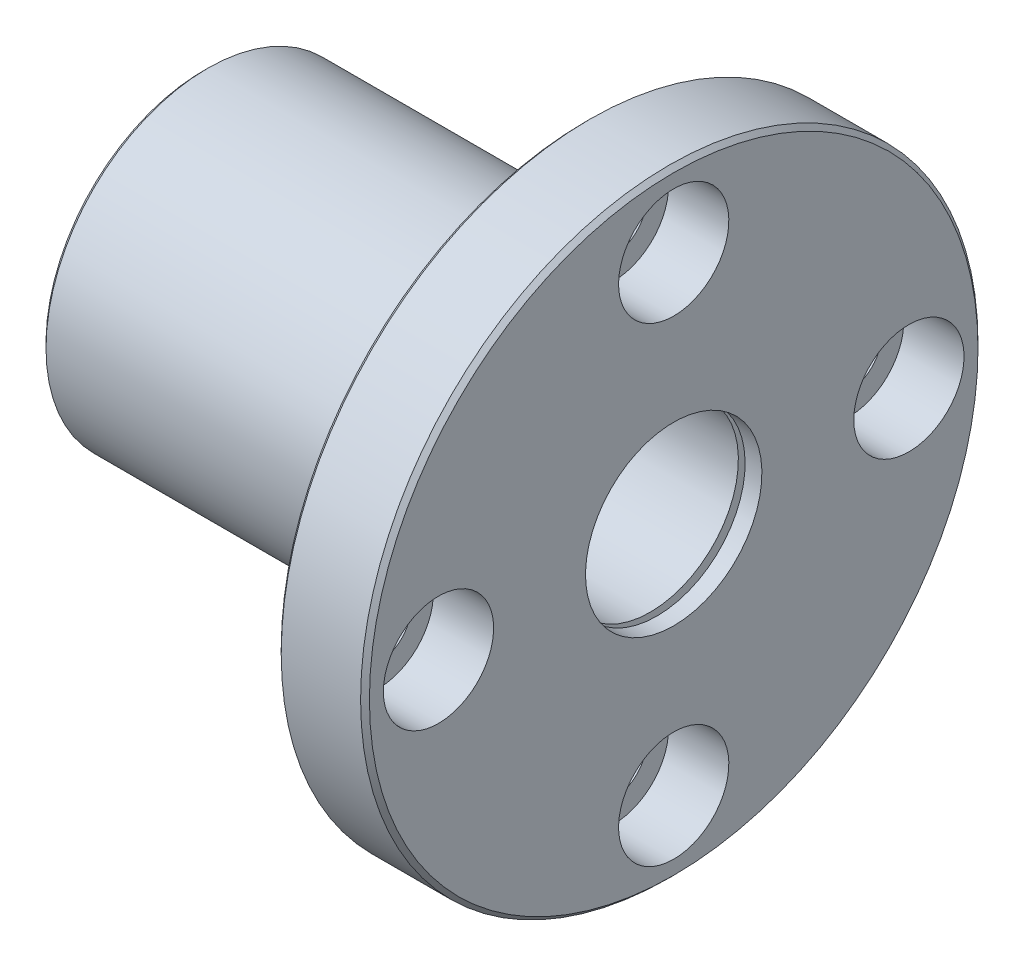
ISO-10303-21;
HEADER;
FILE_DESCRIPTION(('STEP AP214'),'2;1');
FILE_NAME('part.step','',(''),(''),'','','');
FILE_SCHEMA(('AUTOMOTIVE_DESIGN { 1 0 10303 214 1 1 1 1 }'));
ENDSEC;
DATA;
#1=APPLICATION_CONTEXT('core data for automotive mechanical design processes');
#2=APPLICATION_PROTOCOL_DEFINITION('international standard','automotive_design',2000,#1);
#3=PRODUCT_CONTEXT('',#1,'mechanical');
#4=PRODUCT('Part','Part','',(#3));
#5=PRODUCT_RELATED_PRODUCT_CATEGORY('part','',(#4));
#6=PRODUCT_DEFINITION_FORMATION('','',#4);
#7=PRODUCT_DEFINITION_CONTEXT('part definition',#1,'design');
#8=PRODUCT_DEFINITION('design','',#6,#7);
#9=PRODUCT_DEFINITION_SHAPE('','',#8);
#10=(LENGTH_UNIT() NAMED_UNIT(*) SI_UNIT(.MILLI.,.METRE.));
#11=(NAMED_UNIT(*) PLANE_ANGLE_UNIT() SI_UNIT($,.RADIAN.));
#12=(NAMED_UNIT(*) SI_UNIT($,.STERADIAN.) SOLID_ANGLE_UNIT());
#13=UNCERTAINTY_MEASURE_WITH_UNIT(LENGTH_MEASURE(1.E-05),#10,'distance_accuracy_value','');
#14=(GEOMETRIC_REPRESENTATION_CONTEXT(3) GLOBAL_UNCERTAINTY_ASSIGNED_CONTEXT((#13)) GLOBAL_UNIT_ASSIGNED_CONTEXT((#10,
#11,#12)) REPRESENTATION_CONTEXT('',''));
#15=CARTESIAN_POINT('',(0.,0.,0.));
#16=DIRECTION('',(0.,0.,1.));
#17=DIRECTION('',(1.,0.,0.));
#18=AXIS2_PLACEMENT_3D('',#15,#16,#17);
#19=CARTESIAN_POINT('',(0.,8.6,0.));
#20=DIRECTION('',(-1.,0.,0.));
#21=DIRECTION('',(0.,0.,1.));
#22=AXIS2_PLACEMENT_3D('',#19,#20,#21);
#23=PLANE('',#22);
#24=CARTESIAN_POINT('',(0.,0.,0.));
#25=DIRECTION('',(-1.,0.,0.));
#26=DIRECTION('',(0.,1.,0.));
#27=AXIS2_PLACEMENT_3D('',#24,#25,#26);
#28=CIRCLE('',#27,6.5);
#29=CARTESIAN_POINT('',(0.,-6.5,0.));
#30=VERTEX_POINT('',#29);
#31=EDGE_CURVE('E229',#30,#30,#28,.T.);
#32=ORIENTED_EDGE('',*,*,#31,.F.);
#33=EDGE_LOOP('',(#32));
#34=FACE_BOUND('',#33,.T.);
#35=CARTESIAN_POINT('',(0.,0.,0.));
#36=DIRECTION('',(-1.,0.,0.));
#37=DIRECTION('',(0.,1.,0.));
#38=AXIS2_PLACEMENT_3D('',#35,#36,#37);
#39=CIRCLE('',#38,10.7);
#40=CARTESIAN_POINT('',(0.,-10.7,0.));
#41=VERTEX_POINT('',#40);
#42=EDGE_CURVE('E238',#41,#41,#39,.T.);
#43=ORIENTED_EDGE('',*,*,#42,.T.);
#44=EDGE_LOOP('',(#43));
#45=FACE_BOUND('',#44,.T.);
#46=ADVANCED_FACE('F16',(#34,#45),#23,.T.);
#47=CARTESIAN_POINT('',(26.,16.0190437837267,0.));
#48=DIRECTION('',(-1.,0.,0.));
#49=DIRECTION('',(0.,0.,1.));
#50=AXIS2_PLACEMENT_3D('',#47,#48,#49);
#51=PLANE('',#50);
#52=CARTESIAN_POINT('',(26.,0.,0.));
#53=DIRECTION('',(-1.,0.,0.));
#54=DIRECTION('',(0.,1.,0.));
#55=AXIS2_PLACEMENT_3D('',#52,#53,#54);
#56=CIRCLE('',#55,11.3380875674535);
#57=CARTESIAN_POINT('',(26.,11.3380875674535,0.));
#58=VERTEX_POINT('',#57);
#59=CARTESIAN_POINT('',(26.,0.,-11.3380875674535));
#60=VERTEX_POINT('',#59);
#61=EDGE_CURVE('E216',#58,#60,#56,.T.);
#62=ORIENTED_EDGE('',*,*,#61,.F.);
#63=CARTESIAN_POINT('',(26.,0.,0.));
#64=DIRECTION('',(-1.,0.,0.));
#65=DIRECTION('',(0.,1.,0.));
#66=AXIS2_PLACEMENT_3D('',#63,#64,#65);
#67=CIRCLE('',#66,11.3380875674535);
#68=EDGE_CURVE('E214',#60,#58,#67,.T.);
#69=ORIENTED_EDGE('',*,*,#68,.F.);
#70=EDGE_LOOP('',(#62,#69));
#71=FACE_BOUND('',#70,.T.);
#72=CARTESIAN_POINT('',(26.,16.,0.));
#73=DIRECTION('',(1.,0.,0.));
#74=DIRECTION('',(0.,1.,0.));
#75=AXIS2_PLACEMENT_3D('',#72,#73,#74);
#76=CIRCLE('',#75,2.25);
#77=CARTESIAN_POINT('',(26.,13.75,0.));
#78=VERTEX_POINT('',#77);
#79=EDGE_CURVE('E328',#78,#78,#76,.T.);
#80=ORIENTED_EDGE('',*,*,#79,.T.);
#81=EDGE_LOOP('',(#80));
#82=FACE_BOUND('',#81,.T.);
#83=CARTESIAN_POINT('',(26.,-16.,0.));
#84=DIRECTION('',(1.,0.,0.));
#85=DIRECTION('',(0.,1.,0.));
#86=AXIS2_PLACEMENT_3D('',#83,#84,#85);
#87=CIRCLE('',#86,2.25);
#88=CARTESIAN_POINT('',(26.,-18.25,0.));
#89=VERTEX_POINT('',#88);
#90=EDGE_CURVE('E350',#89,#89,#87,.T.);
#91=ORIENTED_EDGE('',*,*,#90,.T.);
#92=EDGE_LOOP('',(#91));
#93=FACE_BOUND('',#92,.T.);
#94=CARTESIAN_POINT('',(26.,0.,16.));
#95=DIRECTION('',(1.,0.,0.));
#96=DIRECTION('',(0.,0.,-1.));
#97=AXIS2_PLACEMENT_3D('',#94,#95,#96);
#98=CIRCLE('',#97,2.25);
#99=CARTESIAN_POINT('',(26.,0.,18.25));
#100=VERTEX_POINT('',#99);
#101=EDGE_CURVE('E299',#100,#100,#98,.T.);
#102=ORIENTED_EDGE('',*,*,#101,.T.);
#103=EDGE_LOOP('',(#102));
#104=FACE_BOUND('',#103,.T.);
#105=CARTESIAN_POINT('',(26.,0.,-16.));
#106=DIRECTION('',(1.,0.,0.));
#107=DIRECTION('',(0.,0.,-1.));
#108=AXIS2_PLACEMENT_3D('',#105,#106,#107);
#109=CIRCLE('',#108,2.25);
#110=CARTESIAN_POINT('',(26.,0.,-13.75));
#111=VERTEX_POINT('',#110);
#112=EDGE_CURVE('E315',#111,#111,#109,.T.);
#113=ORIENTED_EDGE('',*,*,#112,.T.);
#114=EDGE_LOOP('',(#113));
#115=FACE_BOUND('',#114,.T.);
#116=CARTESIAN_POINT('',(26.,0.,0.));
#117=DIRECTION('',(-1.,0.,0.));
#118=DIRECTION('',(0.,1.,0.));
#119=AXIS2_PLACEMENT_3D('',#116,#117,#118);
#120=CIRCLE('',#119,20.7);
#121=CARTESIAN_POINT('',(26.,-20.7,0.));
#122=VERTEX_POINT('',#121);
#123=EDGE_CURVE('E243',#122,#122,#120,.T.);
#124=ORIENTED_EDGE('',*,*,#123,.T.);
#125=EDGE_LOOP('',(#124));
#126=FACE_BOUND('',#125,.T.);
#127=ADVANCED_FACE('F18',(#71,#82,#93,#104,#115,#126),#51,.T.);
#128=CARTESIAN_POINT('',(32.,13.35,0.));
#129=DIRECTION('',(1.,0.,0.));
#130=DIRECTION('',(0.,1.,0.));
#131=AXIS2_PLACEMENT_3D('',#128,#129,#130);
#132=PLANE('',#131);
#133=CARTESIAN_POINT('',(32.,16.,0.));
#134=DIRECTION('',(-1.,0.,0.));
#135=DIRECTION('',(0.,1.,0.));
#136=AXIS2_PLACEMENT_3D('',#133,#134,#135);
#137=CIRCLE('',#136,3.75);
#138=CARTESIAN_POINT('',(32.,12.25,0.));
#139=VERTEX_POINT('',#138);
#140=EDGE_CURVE('E347',#139,#139,#137,.T.);
#141=ORIENTED_EDGE('',*,*,#140,.T.);
#142=EDGE_LOOP('',(#141));
#143=FACE_BOUND('',#142,.T.);
#144=CARTESIAN_POINT('',(32.,-16.,0.));
#145=DIRECTION('',(-1.,0.,0.));
#146=DIRECTION('',(0.,1.,0.));
#147=AXIS2_PLACEMENT_3D('',#144,#145,#146);
#148=CIRCLE('',#147,3.75);
#149=CARTESIAN_POINT('',(32.,-19.75,0.));
#150=VERTEX_POINT('',#149);
#151=EDGE_CURVE('E304',#150,#150,#148,.T.);
#152=ORIENTED_EDGE('',*,*,#151,.T.);
#153=EDGE_LOOP('',(#152));
#154=FACE_BOUND('',#153,.T.);
#155=CARTESIAN_POINT('',(32.,0.,16.));
#156=DIRECTION('',(-1.,0.,0.));
#157=DIRECTION('',(0.,0.,-1.));
#158=AXIS2_PLACEMENT_3D('',#155,#156,#157);
#159=CIRCLE('',#158,3.75);
#160=CARTESIAN_POINT('',(32.,0.,19.75));
#161=VERTEX_POINT('',#160);
#162=EDGE_CURVE('E312',#161,#161,#159,.T.);
#163=ORIENTED_EDGE('',*,*,#162,.T.);
#164=EDGE_LOOP('',(#163));
#165=FACE_BOUND('',#164,.T.);
#166=CARTESIAN_POINT('',(32.,0.,-16.));
#167=DIRECTION('',(-1.,0.,0.));
#168=DIRECTION('',(0.,0.,-1.));
#169=AXIS2_PLACEMENT_3D('',#166,#167,#168);
#170=CIRCLE('',#169,3.75);
#171=CARTESIAN_POINT('',(32.,0.,-12.25));
#172=VERTEX_POINT('',#171);
#173=EDGE_CURVE('E10',#172,#172,#170,.T.);
#174=ORIENTED_EDGE('',*,*,#173,.T.);
#175=EDGE_LOOP('',(#174));
#176=FACE_BOUND('',#175,.T.);
#177=CARTESIAN_POINT('',(32.,0.,0.));
#178=DIRECTION('',(-1.,0.,0.));
#179=DIRECTION('',(0.,1.,0.));
#180=AXIS2_PLACEMENT_3D('',#177,#178,#179);
#181=CIRCLE('',#180,6.);
#182=CARTESIAN_POINT('',(32.,-6.,0.));
#183=VERTEX_POINT('',#182);
#184=EDGE_CURVE('E276',#183,#183,#181,.T.);
#185=ORIENTED_EDGE('',*,*,#184,.T.);
#186=EDGE_LOOP('',(#185));
#187=FACE_BOUND('',#186,.T.);
#188=CARTESIAN_POINT('',(32.,0.,0.));
#189=DIRECTION('',(-1.,0.,0.));
#190=DIRECTION('',(0.,1.,0.));
#191=AXIS2_PLACEMENT_3D('',#188,#189,#190);
#192=CIRCLE('',#191,20.7);
#193=CARTESIAN_POINT('',(32.,-20.7,0.));
#194=VERTEX_POINT('',#193);
#195=EDGE_CURVE('E260',#194,#194,#192,.T.);
#196=ORIENTED_EDGE('',*,*,#195,.F.);
#197=EDGE_LOOP('',(#196));
#198=FACE_BOUND('',#197,.T.);
#199=ADVANCED_FACE('F418',(#143,#154,#165,#176,#187,#198),#132,.T.);
#200=CARTESIAN_POINT('',(30.8571428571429,6.55,0.));
#201=DIRECTION('',(-1.,0.,0.));
#202=DIRECTION('',(0.,0.,1.));
#203=AXIS2_PLACEMENT_3D('',#200,#201,#202);
#204=PLANE('',#203);
#205=CARTESIAN_POINT('',(30.8571428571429,0.,0.));
#206=DIRECTION('',(-1.,0.,0.));
#207=DIRECTION('',(0.,1.,0.));
#208=AXIS2_PLACEMENT_3D('',#205,#206,#207);
#209=CIRCLE('',#208,6.);
#210=CARTESIAN_POINT('',(30.8571428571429,-6.,0.));
#211=VERTEX_POINT('',#210);
#212=EDGE_CURVE('E268',#211,#211,#209,.T.);
#213=ORIENTED_EDGE('',*,*,#212,.F.);
#214=EDGE_LOOP('',(#213));
#215=FACE_BOUND('',#214,.T.);
#216=CARTESIAN_POINT('',(30.8571428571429,0.,0.));
#217=DIRECTION('',(-1.,0.,0.));
#218=DIRECTION('',(0.,1.,0.));
#219=AXIS2_PLACEMENT_3D('',#216,#217,#218);
#220=CIRCLE('',#219,7.1);
#221=CARTESIAN_POINT('',(30.8571428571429,-7.1,0.));
#222=VERTEX_POINT('',#221);
#223=EDGE_CURVE('E287',#222,#222,#220,.T.);
#224=ORIENTED_EDGE('',*,*,#223,.T.);
#225=EDGE_LOOP('',(#224));
#226=FACE_BOUND('',#225,.T.);
#227=ADVANCED_FACE('F494',(#215,#226),#204,.T.);
#228=CARTESIAN_POINT('',(30.4,6.55,0.));
#229=DIRECTION('',(1.,0.,0.));
#230=DIRECTION('',(0.,-1.,0.));
#231=AXIS2_PLACEMENT_3D('',#228,#229,#230);
#232=PLANE('',#231);
#233=CARTESIAN_POINT('',(30.4,0.,0.));
#234=DIRECTION('',(-1.,0.,0.));
#235=DIRECTION('',(0.,1.,0.));
#236=AXIS2_PLACEMENT_3D('',#233,#234,#235);
#237=CIRCLE('',#236,6.);
#238=CARTESIAN_POINT('',(30.4,-6.,0.));
#239=VERTEX_POINT('',#238);
#240=EDGE_CURVE('E298',#239,#239,#237,.T.);
#241=ORIENTED_EDGE('',*,*,#240,.T.);
#242=EDGE_LOOP('',(#241));
#243=FACE_BOUND('',#242,.T.);
#244=CARTESIAN_POINT('',(30.4,0.,0.));
#245=DIRECTION('',(-1.,0.,0.));
#246=DIRECTION('',(0.,1.,0.));
#247=AXIS2_PLACEMENT_3D('',#244,#245,#246);
#248=CIRCLE('',#247,7.1);
#249=CARTESIAN_POINT('',(30.4,-7.1,0.));
#250=VERTEX_POINT('',#249);
#251=EDGE_CURVE('E279',#250,#250,#248,.T.);
#252=ORIENTED_EDGE('',*,*,#251,.F.);
#253=EDGE_LOOP('',(#252));
#254=FACE_BOUND('',#253,.T.);
#255=ADVANCED_FACE('F490',(#243,#254),#232,.T.);
#256=CARTESIAN_POINT('',(1.6,6.55,0.));
#257=DIRECTION('',(-1.,0.,0.));
#258=DIRECTION('',(0.,0.,1.));
#259=AXIS2_PLACEMENT_3D('',#256,#257,#258);
#260=PLANE('',#259);
#261=CARTESIAN_POINT('',(1.6,0.,0.));
#262=DIRECTION('',(-1.,0.,0.));
#263=DIRECTION('',(0.,1.,0.));
#264=AXIS2_PLACEMENT_3D('',#261,#262,#263);
#265=CIRCLE('',#264,6.);
#266=CARTESIAN_POINT('',(1.6,-6.,0.));
#267=VERTEX_POINT('',#266);
#268=EDGE_CURVE('E288',#267,#267,#265,.T.);
#269=ORIENTED_EDGE('',*,*,#268,.F.);
#270=EDGE_LOOP('',(#269));
#271=FACE_BOUND('',#270,.T.);
#272=CARTESIAN_POINT('',(1.6,0.,0.));
#273=DIRECTION('',(-1.,0.,0.));
#274=DIRECTION('',(0.,1.,0.));
#275=AXIS2_PLACEMENT_3D('',#272,#273,#274);
#276=CIRCLE('',#275,7.1);
#277=CARTESIAN_POINT('',(1.6,-7.1,0.));
#278=VERTEX_POINT('',#277);
#279=EDGE_CURVE('E234',#278,#278,#276,.T.);
#280=ORIENTED_EDGE('',*,*,#279,.T.);
#281=EDGE_LOOP('',(#280));
#282=FACE_BOUND('',#281,.T.);
#283=ADVANCED_FACE('F487',(#271,#282),#260,.T.);
#284=CARTESIAN_POINT('',(1.14285714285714,6.8,0.));
#285=DIRECTION('',(1.,0.,0.));
#286=DIRECTION('',(0.,1.,0.));
#287=AXIS2_PLACEMENT_3D('',#284,#285,#286);
#288=PLANE('',#287);
#289=CARTESIAN_POINT('',(1.14285714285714,0.,0.));
#290=DIRECTION('',(-1.,0.,0.));
#291=DIRECTION('',(0.,1.,0.));
#292=AXIS2_PLACEMENT_3D('',#289,#290,#291);
#293=CIRCLE('',#292,6.5);
#294=CARTESIAN_POINT('',(1.14285714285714,-6.5,0.));
#295=VERTEX_POINT('',#294);
#296=EDGE_CURVE('E325',#295,#295,#293,.T.);
#297=ORIENTED_EDGE('',*,*,#296,.T.);
#298=EDGE_LOOP('',(#297));
#299=FACE_BOUND('',#298,.T.);
#300=CARTESIAN_POINT('',(1.14285714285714,0.,0.));
#301=DIRECTION('',(-1.,0.,0.));
#302=DIRECTION('',(0.,1.,0.));
#303=AXIS2_PLACEMENT_3D('',#300,#301,#302);
#304=CIRCLE('',#303,7.1);
#305=CARTESIAN_POINT('',(1.14285714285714,-7.1,0.));
#306=VERTEX_POINT('',#305);
#307=EDGE_CURVE('E307',#306,#306,#304,.T.);
#308=ORIENTED_EDGE('',*,*,#307,.F.);
#309=EDGE_LOOP('',(#308));
#310=FACE_BOUND('',#309,.T.);
#311=ADVANCED_FACE('F469',(#299,#310),#288,.T.);
#312=CARTESIAN_POINT('',(27.9,19.,0.));
#313=DIRECTION('',(-1.,0.,0.));
#314=DIRECTION('',(0.,0.,1.));
#315=AXIS2_PLACEMENT_3D('',#312,#313,#314);
#316=PLANE('',#315);
#317=CARTESIAN_POINT('',(27.9,16.,0.));
#318=DIRECTION('',(-1.,0.,0.));
#319=DIRECTION('',(0.,1.,0.));
#320=AXIS2_PLACEMENT_3D('',#317,#318,#319);
#321=CIRCLE('',#320,2.25);
#322=CARTESIAN_POINT('',(27.9,13.75,0.));
#323=VERTEX_POINT('',#322);
#324=EDGE_CURVE('E336',#323,#323,#321,.T.);
#325=ORIENTED_EDGE('',*,*,#324,.T.);
#326=EDGE_LOOP('',(#325));
#327=FACE_BOUND('',#326,.T.);
#328=CARTESIAN_POINT('',(27.9,16.,0.));
#329=DIRECTION('',(-1.,0.,0.));
#330=DIRECTION('',(0.,1.,0.));
#331=AXIS2_PLACEMENT_3D('',#328,#329,#330);
#332=CIRCLE('',#331,3.75);
#333=CARTESIAN_POINT('',(27.9,12.25,0.));
#334=VERTEX_POINT('',#333);
#335=EDGE_CURVE('E339',#334,#334,#332,.T.);
#336=ORIENTED_EDGE('',*,*,#335,.F.);
#337=EDGE_LOOP('',(#336));
#338=FACE_BOUND('',#337,.T.);
#339=ADVANCED_FACE('F465',(#327,#338),#316,.F.);
#340=CARTESIAN_POINT('',(27.9,-13.,0.));
#341=DIRECTION('',(-1.,0.,0.));
#342=DIRECTION('',(0.,0.,1.));
#343=AXIS2_PLACEMENT_3D('',#340,#341,#342);
#344=PLANE('',#343);
#345=CARTESIAN_POINT('',(27.9,-16.,0.));
#346=DIRECTION('',(-1.,0.,0.));
#347=DIRECTION('',(0.,1.,0.));
#348=AXIS2_PLACEMENT_3D('',#345,#346,#347);
#349=CIRCLE('',#348,2.25);
#350=CARTESIAN_POINT('',(27.9,-18.25,0.));
#351=VERTEX_POINT('',#350);
#352=EDGE_CURVE('E358',#351,#351,#349,.T.);
#353=ORIENTED_EDGE('',*,*,#352,.T.);
#354=EDGE_LOOP('',(#353));
#355=FACE_BOUND('',#354,.T.);
#356=CARTESIAN_POINT('',(27.9,-16.,0.));
#357=DIRECTION('',(-1.,0.,0.));
#358=DIRECTION('',(0.,1.,0.));
#359=AXIS2_PLACEMENT_3D('',#356,#357,#358);
#360=CIRCLE('',#359,3.75);
#361=CARTESIAN_POINT('',(27.9,-19.75,0.));
#362=VERTEX_POINT('',#361);
#363=EDGE_CURVE('E361',#362,#362,#360,.T.);
#364=ORIENTED_EDGE('',*,*,#363,.F.);
#365=EDGE_LOOP('',(#364));
#366=FACE_BOUND('',#365,.T.);
#367=ADVANCED_FACE('F468',(#355,#366),#344,.F.);
#368=CARTESIAN_POINT('',(27.9,0.,13.));
#369=DIRECTION('',(-1.,0.,0.));
#370=DIRECTION('',(0.,0.,1.));
#371=AXIS2_PLACEMENT_3D('',#368,#369,#370);
#372=PLANE('',#371);
#373=CARTESIAN_POINT('',(27.9,0.,16.));
#374=DIRECTION('',(-1.,0.,0.));
#375=DIRECTION('',(0.,0.,-1.));
#376=AXIS2_PLACEMENT_3D('',#373,#374,#375);
#377=CIRCLE('',#376,2.25);
#378=CARTESIAN_POINT('',(27.9,0.,18.25));
#379=VERTEX_POINT('',#378);
#380=EDGE_CURVE('E377',#379,#379,#377,.T.);
#381=ORIENTED_EDGE('',*,*,#380,.T.);
#382=EDGE_LOOP('',(#381));
#383=FACE_BOUND('',#382,.T.);
#384=CARTESIAN_POINT('',(27.9,0.,16.));
#385=DIRECTION('',(-1.,0.,0.));
#386=DIRECTION('',(0.,0.,-1.));
#387=AXIS2_PLACEMENT_3D('',#384,#385,#386);
#388=CIRCLE('',#387,3.75);
#389=CARTESIAN_POINT('',(27.9,0.,19.75));
#390=VERTEX_POINT('',#389);
#391=EDGE_CURVE('E380',#390,#390,#388,.T.);
#392=ORIENTED_EDGE('',*,*,#391,.F.);
#393=EDGE_LOOP('',(#392));
#394=FACE_BOUND('',#393,.T.);
#395=ADVANCED_FACE('F409',(#383,#394),#372,.F.);
#396=CARTESIAN_POINT('',(27.9,0.,-19.));
#397=DIRECTION('',(-1.,0.,0.));
#398=DIRECTION('',(0.,0.,1.));
#399=AXIS2_PLACEMENT_3D('',#396,#397,#398);
#400=PLANE('',#399);
#401=CARTESIAN_POINT('',(27.9,0.,-16.));
#402=DIRECTION('',(-1.,0.,0.));
#403=DIRECTION('',(0.,0.,-1.));
#404=AXIS2_PLACEMENT_3D('',#401,#402,#403);
#405=CIRCLE('',#404,2.25);
#406=CARTESIAN_POINT('',(27.9,0.,-13.75));
#407=VERTEX_POINT('',#406);
#408=EDGE_CURVE('E261',#407,#407,#405,.T.);
#409=ORIENTED_EDGE('',*,*,#408,.T.);
#410=EDGE_LOOP('',(#409));
#411=FACE_BOUND('',#410,.T.);
#412=CARTESIAN_POINT('',(27.9,0.,-16.));
#413=DIRECTION('',(-1.,0.,0.));
#414=DIRECTION('',(0.,0.,-1.));
#415=AXIS2_PLACEMENT_3D('',#412,#413,#414);
#416=CIRCLE('',#415,3.75);
#417=CARTESIAN_POINT('',(27.9,0.,-12.25));
#418=VERTEX_POINT('',#417);
#419=EDGE_CURVE('E264',#418,#418,#416,.T.);
#420=ORIENTED_EDGE('',*,*,#419,.F.);
#421=EDGE_LOOP('',(#420));
#422=FACE_BOUND('',#421,.T.);
#423=ADVANCED_FACE('F399',(#411,#422),#400,.F.);
#424=CARTESIAN_POINT('',(29.95,0.,-16.));
#425=DIRECTION('',(1.,0.,0.));
#426=DIRECTION('',(0.,0.,-1.));
#427=AXIS2_PLACEMENT_3D('',#424,#425,#426);
#428=CYLINDRICAL_SURFACE('',#427,3.75);
#429=ORIENTED_EDGE('',*,*,#419,.T.);
#430=DIRECTION('',(1.,0.,0.));
#431=VECTOR('',#430,1.);
#432=CARTESIAN_POINT('',(29.95,0.,-12.25));
#433=LINE('',#432,#431);
#434=EDGE_CURVE('E20',#418,#172,#433,.T.);
#435=ORIENTED_EDGE('',*,*,#434,.T.);
#436=ORIENTED_EDGE('',*,*,#173,.F.);
#437=ORIENTED_EDGE('',*,*,#434,.F.);
#438=EDGE_LOOP('',(#429,#435,#436,#437));
#439=FACE_BOUND('',#438,.T.);
#440=ADVANCED_FACE('F396',(#439),#428,.F.);
#441=CARTESIAN_POINT('',(26.95,0.,-16.));
#442=DIRECTION('',(1.,0.,0.));
#443=DIRECTION('',(0.,0.,-1.));
#444=AXIS2_PLACEMENT_3D('',#441,#442,#443);
#445=CYLINDRICAL_SURFACE('',#444,2.25);
#446=ORIENTED_EDGE('',*,*,#112,.F.);
#447=DIRECTION('',(1.,0.,0.));
#448=VECTOR('',#447,1.);
#449=CARTESIAN_POINT('',(26.95,0.,-13.75));
#450=LINE('',#449,#448);
#451=EDGE_CURVE('E265',#111,#407,#450,.T.);
#452=ORIENTED_EDGE('',*,*,#451,.T.);
#453=ORIENTED_EDGE('',*,*,#408,.F.);
#454=ORIENTED_EDGE('',*,*,#451,.F.);
#455=EDGE_LOOP('',(#446,#452,#453,#454));
#456=FACE_BOUND('',#455,.T.);
#457=ADVANCED_FACE('F398',(#456),#445,.F.);
#458=CARTESIAN_POINT('',(29.95,0.,16.));
#459=DIRECTION('',(1.,0.,0.));
#460=DIRECTION('',(0.,0.,-1.));
#461=AXIS2_PLACEMENT_3D('',#458,#459,#460);
#462=CYLINDRICAL_SURFACE('',#461,3.75);
#463=ORIENTED_EDGE('',*,*,#391,.T.);
#464=DIRECTION('',(1.,0.,0.));
#465=VECTOR('',#464,1.);
#466=CARTESIAN_POINT('',(29.95,0.,19.75));
#467=LINE('',#466,#465);
#468=EDGE_CURVE('E316',#390,#161,#467,.T.);
#469=ORIENTED_EDGE('',*,*,#468,.T.);
#470=ORIENTED_EDGE('',*,*,#162,.F.);
#471=ORIENTED_EDGE('',*,*,#468,.F.);
#472=EDGE_LOOP('',(#463,#469,#470,#471));
#473=FACE_BOUND('',#472,.T.);
#474=ADVANCED_FACE('F406',(#473),#462,.F.);
#475=CARTESIAN_POINT('',(26.95,0.,16.));
#476=DIRECTION('',(1.,0.,0.));
#477=DIRECTION('',(0.,0.,-1.));
#478=AXIS2_PLACEMENT_3D('',#475,#476,#477);
#479=CYLINDRICAL_SURFACE('',#478,2.25);
#480=ORIENTED_EDGE('',*,*,#101,.F.);
#481=DIRECTION('',(1.,0.,0.));
#482=VECTOR('',#481,1.);
#483=CARTESIAN_POINT('',(26.95,0.,18.25));
#484=LINE('',#483,#482);
#485=EDGE_CURVE('E303',#100,#379,#484,.T.);
#486=ORIENTED_EDGE('',*,*,#485,.T.);
#487=ORIENTED_EDGE('',*,*,#380,.F.);
#488=ORIENTED_EDGE('',*,*,#485,.F.);
#489=EDGE_LOOP('',(#480,#486,#487,#488));
#490=FACE_BOUND('',#489,.T.);
#491=ADVANCED_FACE('F461',(#490),#479,.F.);
#492=CARTESIAN_POINT('',(29.95,-16.,0.));
#493=DIRECTION('',(1.,0.,0.));
#494=DIRECTION('',(0.,1.,0.));
#495=AXIS2_PLACEMENT_3D('',#492,#493,#494);
#496=CYLINDRICAL_SURFACE('',#495,3.75);
#497=ORIENTED_EDGE('',*,*,#363,.T.);
#498=DIRECTION('',(1.,0.,0.));
#499=VECTOR('',#498,1.);
#500=CARTESIAN_POINT('',(29.95,-19.75,0.));
#501=LINE('',#500,#499);
#502=EDGE_CURVE('E368',#362,#150,#501,.T.);
#503=ORIENTED_EDGE('',*,*,#502,.T.);
#504=ORIENTED_EDGE('',*,*,#151,.F.);
#505=ORIENTED_EDGE('',*,*,#502,.F.);
#506=EDGE_LOOP('',(#497,#503,#504,#505));
#507=FACE_BOUND('',#506,.T.);
#508=ADVANCED_FACE('F439',(#507),#496,.F.);
#509=CARTESIAN_POINT('',(26.95,-16.,0.));
#510=DIRECTION('',(1.,0.,0.));
#511=DIRECTION('',(0.,1.,0.));
#512=AXIS2_PLACEMENT_3D('',#509,#510,#511);
#513=CYLINDRICAL_SURFACE('',#512,2.25);
#514=ORIENTED_EDGE('',*,*,#90,.F.);
#515=DIRECTION('',(1.,0.,0.));
#516=VECTOR('',#515,1.);
#517=CARTESIAN_POINT('',(26.95,-18.25,0.));
#518=LINE('',#517,#516);
#519=EDGE_CURVE('E353',#89,#351,#518,.T.);
#520=ORIENTED_EDGE('',*,*,#519,.T.);
#521=ORIENTED_EDGE('',*,*,#352,.F.);
#522=ORIENTED_EDGE('',*,*,#519,.F.);
#523=EDGE_LOOP('',(#514,#520,#521,#522));
#524=FACE_BOUND('',#523,.T.);
#525=ADVANCED_FACE('F435',(#524),#513,.F.);
#526=CARTESIAN_POINT('',(29.95,16.,0.));
#527=DIRECTION('',(1.,0.,0.));
#528=DIRECTION('',(0.,1.,0.));
#529=AXIS2_PLACEMENT_3D('',#526,#527,#528);
#530=CYLINDRICAL_SURFACE('',#529,3.75);
#531=ORIENTED_EDGE('',*,*,#335,.T.);
#532=DIRECTION('',(1.,0.,0.));
#533=VECTOR('',#532,1.);
#534=CARTESIAN_POINT('',(29.95,12.25,0.));
#535=LINE('',#534,#533);
#536=EDGE_CURVE('E343',#334,#139,#535,.T.);
#537=ORIENTED_EDGE('',*,*,#536,.T.);
#538=ORIENTED_EDGE('',*,*,#140,.F.);
#539=ORIENTED_EDGE('',*,*,#536,.F.);
#540=EDGE_LOOP('',(#531,#537,#538,#539));
#541=FACE_BOUND('',#540,.T.);
#542=ADVANCED_FACE('F438',(#541),#530,.F.);
#543=CARTESIAN_POINT('',(26.95,16.,0.));
#544=DIRECTION('',(1.,0.,0.));
#545=DIRECTION('',(0.,1.,0.));
#546=AXIS2_PLACEMENT_3D('',#543,#544,#545);
#547=CYLINDRICAL_SURFACE('',#546,2.25);
#548=ORIENTED_EDGE('',*,*,#79,.F.);
#549=DIRECTION('',(1.,0.,0.));
#550=VECTOR('',#549,1.);
#551=CARTESIAN_POINT('',(26.95,13.75,0.));
#552=LINE('',#551,#550);
#553=EDGE_CURVE('E332',#78,#323,#552,.T.);
#554=ORIENTED_EDGE('',*,*,#553,.T.);
#555=ORIENTED_EDGE('',*,*,#324,.F.);
#556=ORIENTED_EDGE('',*,*,#553,.F.);
#557=EDGE_LOOP('',(#548,#554,#555,#556));
#558=FACE_BOUND('',#557,.T.);
#559=ADVANCED_FACE('F453',(#558),#547,.F.);
#560=CARTESIAN_POINT('',(0.571428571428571,0.,0.));
#561=DIRECTION('',(1.,0.,0.));
#562=DIRECTION('',(0.,1.,0.));
#563=AXIS2_PLACEMENT_3D('',#560,#561,#562);
#564=CYLINDRICAL_SURFACE('',#563,6.5);
#565=ORIENTED_EDGE('',*,*,#31,.T.);
#566=DIRECTION('',(1.,0.,0.));
#567=VECTOR('',#566,1.);
#568=CARTESIAN_POINT('',(0.571428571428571,-6.5,0.));
#569=LINE('',#568,#567);
#570=EDGE_CURVE('E233',#30,#295,#569,.T.);
#571=ORIENTED_EDGE('',*,*,#570,.T.);
#572=ORIENTED_EDGE('',*,*,#296,.F.);
#573=ORIENTED_EDGE('',*,*,#570,.F.);
#574=EDGE_LOOP('',(#565,#571,#572,#573));
#575=FACE_BOUND('',#574,.T.);
#576=ADVANCED_FACE('F450',(#575),#564,.F.);
#577=CARTESIAN_POINT('',(1.37142857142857,0.,0.));
#578=DIRECTION('',(1.,0.,0.));
#579=DIRECTION('',(0.,1.,0.));
#580=AXIS2_PLACEMENT_3D('',#577,#578,#579);
#581=CYLINDRICAL_SURFACE('',#580,7.1);
#582=ORIENTED_EDGE('',*,*,#307,.T.);
#583=DIRECTION('',(1.,0.,0.));
#584=VECTOR('',#583,1.);
#585=CARTESIAN_POINT('',(1.37142857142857,-7.1,0.));
#586=LINE('',#585,#584);
#587=EDGE_CURVE('E311',#306,#278,#586,.T.);
#588=ORIENTED_EDGE('',*,*,#587,.T.);
#589=ORIENTED_EDGE('',*,*,#279,.F.);
#590=ORIENTED_EDGE('',*,*,#587,.F.);
#591=EDGE_LOOP('',(#582,#588,#589,#590));
#592=FACE_BOUND('',#591,.T.);
#593=ADVANCED_FACE('F448',(#592),#581,.F.);
#594=CARTESIAN_POINT('',(16.,0.,0.));
#595=DIRECTION('',(1.,0.,0.));
#596=DIRECTION('',(0.,1.,0.));
#597=AXIS2_PLACEMENT_3D('',#594,#595,#596);
#598=CYLINDRICAL_SURFACE('',#597,6.);
#599=ORIENTED_EDGE('',*,*,#268,.T.);
#600=DIRECTION('',(1.,0.,0.));
#601=VECTOR('',#600,1.);
#602=CARTESIAN_POINT('',(16.,-6.,0.));
#603=LINE('',#602,#601);
#604=EDGE_CURVE('E292',#267,#239,#603,.T.);
#605=ORIENTED_EDGE('',*,*,#604,.T.);
#606=ORIENTED_EDGE('',*,*,#240,.F.);
#607=ORIENTED_EDGE('',*,*,#604,.F.);
#608=EDGE_LOOP('',(#599,#605,#606,#607));
#609=FACE_BOUND('',#608,.T.);
#610=ADVANCED_FACE('F445',(#609),#598,.F.);
#611=CARTESIAN_POINT('',(30.6285714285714,0.,0.));
#612=DIRECTION('',(1.,0.,0.));
#613=DIRECTION('',(0.,1.,0.));
#614=AXIS2_PLACEMENT_3D('',#611,#612,#613);
#615=CYLINDRICAL_SURFACE('',#614,7.1);
#616=ORIENTED_EDGE('',*,*,#251,.T.);
#617=DIRECTION('',(1.,0.,0.));
#618=VECTOR('',#617,1.);
#619=CARTESIAN_POINT('',(30.6285714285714,-7.1,0.));
#620=LINE('',#619,#618);
#621=EDGE_CURVE('E283',#250,#222,#620,.T.);
#622=ORIENTED_EDGE('',*,*,#621,.T.);
#623=ORIENTED_EDGE('',*,*,#223,.F.);
#624=ORIENTED_EDGE('',*,*,#621,.F.);
#625=EDGE_LOOP('',(#616,#622,#623,#624));
#626=FACE_BOUND('',#625,.T.);
#627=ADVANCED_FACE('F443',(#626),#615,.F.);
#628=CARTESIAN_POINT('',(31.4285714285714,0.,0.));
#629=DIRECTION('',(1.,0.,0.));
#630=DIRECTION('',(0.,1.,0.));
#631=AXIS2_PLACEMENT_3D('',#628,#629,#630);
#632=CYLINDRICAL_SURFACE('',#631,6.);
#633=ORIENTED_EDGE('',*,*,#212,.T.);
#634=DIRECTION('',(1.,0.,0.));
#635=VECTOR('',#634,1.);
#636=CARTESIAN_POINT('',(31.4285714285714,-6.,0.));
#637=LINE('',#636,#635);
#638=EDGE_CURVE('E272',#211,#183,#637,.T.);
#639=ORIENTED_EDGE('',*,*,#638,.T.);
#640=ORIENTED_EDGE('',*,*,#184,.F.);
#641=ORIENTED_EDGE('',*,*,#638,.F.);
#642=EDGE_LOOP('',(#633,#639,#640,#641));
#643=FACE_BOUND('',#642,.T.);
#644=ADVANCED_FACE('F433',(#643),#632,.F.);
#645=CARTESIAN_POINT('',(31.85,0.,0.));
#646=DIRECTION('',(-1.,0.,0.));
#647=DIRECTION('',(0.,1.,0.));
#648=AXIS2_PLACEMENT_3D('',#645,#646,#647);
#649=CONICAL_SURFACE('',#648,20.85,0.785398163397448);
#650=CARTESIAN_POINT('',(31.7,0.,0.));
#651=DIRECTION('',(-1.,0.,0.));
#652=DIRECTION('',(0.,1.,0.));
#653=AXIS2_PLACEMENT_3D('',#650,#651,#652);
#654=CIRCLE('',#653,21.);
#655=CARTESIAN_POINT('',(31.7,-21.,0.));
#656=VERTEX_POINT('',#655);
#657=EDGE_CURVE('E245',#656,#656,#654,.T.);
#658=ORIENTED_EDGE('',*,*,#657,.F.);
#659=DIRECTION('',(0.707106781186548,0.707106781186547,0.));
#660=VECTOR('',#659,1.);
#661=CARTESIAN_POINT('',(31.85,-20.85,0.));
#662=LINE('',#661,#660);
#663=EDGE_CURVE('E256',#656,#194,#662,.T.);
#664=ORIENTED_EDGE('',*,*,#663,.T.);
#665=ORIENTED_EDGE('',*,*,#195,.T.);
#666=ORIENTED_EDGE('',*,*,#663,.F.);
#667=EDGE_LOOP('',(#658,#664,#665,#666));
#668=FACE_BOUND('',#667,.T.);
#669=ADVANCED_FACE('F429',(#668),#649,.T.);
#670=CARTESIAN_POINT('',(29.,0.,0.));
#671=DIRECTION('',(1.,0.,0.));
#672=DIRECTION('',(0.,1.,0.));
#673=AXIS2_PLACEMENT_3D('',#670,#671,#672);
#674=CYLINDRICAL_SURFACE('',#673,21.);
#675=ORIENTED_EDGE('',*,*,#657,.T.);
#676=DIRECTION('',(-1.,0.,0.));
#677=VECTOR('',#676,1.);
#678=CARTESIAN_POINT('',(29.,-21.,0.));
#679=LINE('',#678,#677);
#680=CARTESIAN_POINT('',(26.3,-21.,0.));
#681=VERTEX_POINT('',#680);
#682=EDGE_CURVE('E253',#656,#681,#679,.T.);
#683=ORIENTED_EDGE('',*,*,#682,.T.);
#684=CARTESIAN_POINT('',(26.3,0.,0.));
#685=DIRECTION('',(-1.,0.,0.));
#686=DIRECTION('',(0.,1.,0.));
#687=AXIS2_PLACEMENT_3D('',#684,#685,#686);
#688=CIRCLE('',#687,21.);
#689=EDGE_CURVE('E194',#681,#681,#688,.T.);
#690=ORIENTED_EDGE('',*,*,#689,.F.);
#691=ORIENTED_EDGE('',*,*,#682,.F.);
#692=EDGE_LOOP('',(#675,#683,#690,#691));
#693=FACE_BOUND('',#692,.T.);
#694=ADVANCED_FACE('F425',(#693),#674,.T.);
#695=CARTESIAN_POINT('',(26.15,0.,0.));
#696=DIRECTION('',(1.,0.,0.));
#697=DIRECTION('',(0.,1.,0.));
#698=AXIS2_PLACEMENT_3D('',#695,#696,#697);
#699=CONICAL_SURFACE('',#698,20.85,0.785398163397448);
#700=ORIENTED_EDGE('',*,*,#689,.T.);
#701=DIRECTION('',(-0.707106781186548,0.707106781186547,0.));
#702=VECTOR('',#701,1.);
#703=CARTESIAN_POINT('',(26.15,-20.85,0.));
#704=LINE('',#703,#702);
#705=EDGE_CURVE('E212',#681,#122,#704,.T.);
#706=ORIENTED_EDGE('',*,*,#705,.T.);
#707=ORIENTED_EDGE('',*,*,#123,.F.);
#708=ORIENTED_EDGE('',*,*,#705,.F.);
#709=EDGE_LOOP('',(#700,#706,#707,#708));
#710=FACE_BOUND('',#709,.T.);
#711=ADVANCED_FACE('F428',(#710),#699,.T.);
#712=CARTESIAN_POINT('',(24.7323445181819,0.,0.));
#713=DIRECTION('',(-1.,0.,0.));
#714=DIRECTION('',(0.,1.,0.));
#715=AXIS2_PLACEMENT_3D('',#712,#713,#714);
#716=CONICAL_SURFACE('',#715,10.8767721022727,0.227474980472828);
#717=CARTESIAN_POINT('',(24.2,0.,0.));
#718=DIRECTION('',(-1.,0.,0.));
#719=DIRECTION('',(0.,1.,0.));
#720=AXIS2_PLACEMENT_3D('',#717,#718,#719);
#721=CIRCLE('',#720,11.);
#722=CARTESIAN_POINT('',(24.2,-11.,0.));
#723=VERTEX_POINT('',#722);
#724=EDGE_CURVE('E191',#723,#723,#721,.T.);
#725=ORIENTED_EDGE('',*,*,#724,.F.);
#726=DIRECTION('',(0.974238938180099,0.225518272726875,0.));
#727=VECTOR('',#726,1.);
#728=CARTESIAN_POINT('',(24.7323445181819,-10.8767721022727,0.));
#729=LINE('',#728,#727);
#730=CARTESIAN_POINT('',(25.2646890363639,-10.7535442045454,0.));
#731=VERTEX_POINT('',#730);
#732=EDGE_CURVE('E185',#723,#731,#729,.T.);
#733=ORIENTED_EDGE('',*,*,#732,.T.);
#734=CARTESIAN_POINT('',(25.2646890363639,0.,0.));
#735=DIRECTION('',(-1.,0.,0.));
#736=DIRECTION('',(0.,1.,0.));
#737=AXIS2_PLACEMENT_3D('',#734,#735,#736);
#738=CIRCLE('',#737,10.7535442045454);
#739=CARTESIAN_POINT('',(25.2646890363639,0.,-10.7535442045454));
#740=VERTEX_POINT('',#739);
#741=EDGE_CURVE('E189',#731,#740,#738,.T.);
#742=ORIENTED_EDGE('',*,*,#741,.T.);
#743=CARTESIAN_POINT('',(25.2646890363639,0.,0.));
#744=DIRECTION('',(-1.,0.,0.));
#745=DIRECTION('',(0.,1.,0.));
#746=AXIS2_PLACEMENT_3D('',#743,#744,#745);
#747=CIRCLE('',#746,10.7535442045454);
#748=EDGE_CURVE('E198',#740,#731,#747,.T.);
#749=ORIENTED_EDGE('',*,*,#748,.T.);
#750=ORIENTED_EDGE('',*,*,#732,.F.);
#751=EDGE_LOOP('',(#725,#733,#742,#749,#750));
#752=FACE_BOUND('',#751,.T.);
#753=ADVANCED_FACE('F187',(#752),#716,.T.);
#754=CARTESIAN_POINT('',(12.25,0.,0.));
#755=DIRECTION('',(1.,0.,0.));
#756=DIRECTION('',(0.,1.,0.));
#757=AXIS2_PLACEMENT_3D('',#754,#755,#756);
#758=CYLINDRICAL_SURFACE('',#757,11.);
#759=ORIENTED_EDGE('',*,*,#724,.T.);
#760=DIRECTION('',(-1.,0.,0.));
#761=VECTOR('',#760,1.);
#762=CARTESIAN_POINT('',(12.25,-11.,0.));
#763=LINE('',#762,#761);
#764=CARTESIAN_POINT('',(0.3,-11.,0.));
#765=VERTEX_POINT('',#764);
#766=EDGE_CURVE('E195',#723,#765,#763,.T.);
#767=ORIENTED_EDGE('',*,*,#766,.T.);
#768=CARTESIAN_POINT('',(0.3,0.,0.));
#769=DIRECTION('',(-1.,0.,0.));
#770=DIRECTION('',(0.,1.,0.));
#771=AXIS2_PLACEMENT_3D('',#768,#769,#770);
#772=CIRCLE('',#771,11.);
#773=EDGE_CURVE('E219',#765,#765,#772,.T.);
#774=ORIENTED_EDGE('',*,*,#773,.F.);
#775=ORIENTED_EDGE('',*,*,#766,.F.);
#776=EDGE_LOOP('',(#759,#767,#774,#775));
#777=FACE_BOUND('',#776,.T.);
#778=ADVANCED_FACE('F797',(#777),#758,.T.);
#779=CARTESIAN_POINT('',(0.15,0.,0.));
#780=DIRECTION('',(1.,0.,0.));
#781=DIRECTION('',(0.,1.,0.));
#782=AXIS2_PLACEMENT_3D('',#779,#780,#781);
#783=CONICAL_SURFACE('',#782,10.85,0.785398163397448);
#784=ORIENTED_EDGE('',*,*,#773,.T.);
#785=DIRECTION('',(-0.707106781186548,0.707106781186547,0.));
#786=VECTOR('',#785,1.);
#787=CARTESIAN_POINT('',(0.15,-10.85,0.));
#788=LINE('',#787,#786);
#789=EDGE_CURVE('E228',#765,#41,#788,.T.);
#790=ORIENTED_EDGE('',*,*,#789,.T.);
#791=ORIENTED_EDGE('',*,*,#42,.F.);
#792=ORIENTED_EDGE('',*,*,#789,.F.);
#793=EDGE_LOOP('',(#784,#790,#791,#792));
#794=FACE_BOUND('',#793,.T.);
#795=ADVANCED_FACE('F804',(#794),#783,.T.);
#796=CARTESIAN_POINT('',(25.4,0.,0.));
#797=DIRECTION('',(-1.,0.,0.));
#798=DIRECTION('',(0.,0.,1.));
#799=AXIS2_PLACEMENT_3D('',#796,#797,#798);
#800=TOROIDAL_SURFACE('',#799,11.3380875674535,0.6);
#801=ORIENTED_EDGE('',*,*,#741,.F.);
#802=ORIENTED_EDGE('',*,*,#748,.F.);
#803=CARTESIAN_POINT('',(25.4,0.,-11.3380875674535));
#804=DIRECTION('',(0.,1.,0.));
#805=DIRECTION('',(0.,0.,-1.));
#806=AXIS2_PLACEMENT_3D('',#803,#804,#805);
#807=CIRCLE('',#806,0.6);
#808=EDGE_CURVE('E202',#740,#60,#807,.T.);
#809=ORIENTED_EDGE('',*,*,#808,.T.);
#810=ORIENTED_EDGE('',*,*,#68,.T.);
#811=ORIENTED_EDGE('',*,*,#61,.T.);
#812=ORIENTED_EDGE('',*,*,#808,.F.);
#813=EDGE_LOOP('',(#801,#802,#809,#810,#811,#812));
#814=FACE_BOUND('',#813,.T.);
#815=ADVANCED_FACE('F204',(#814),#800,.F.);
#816=CLOSED_SHELL('',(#46,#127,#199,#227,#255,#283,#311,#339,#367,#395,#423,#440,#457,#474,#491,
#508,#525,#542,#559,#576,#593,#610,#627,#644,#669,#694,#711,#753,#778,#795,#815));
#817=MANIFOLD_SOLID_BREP('B1',#816);
#818=ADVANCED_BREP_SHAPE_REPRESENTATION('',(#18,#817),#14);
#819=SHAPE_DEFINITION_REPRESENTATION(#9,#818);
ENDSEC;
END-ISO-10303-21;
